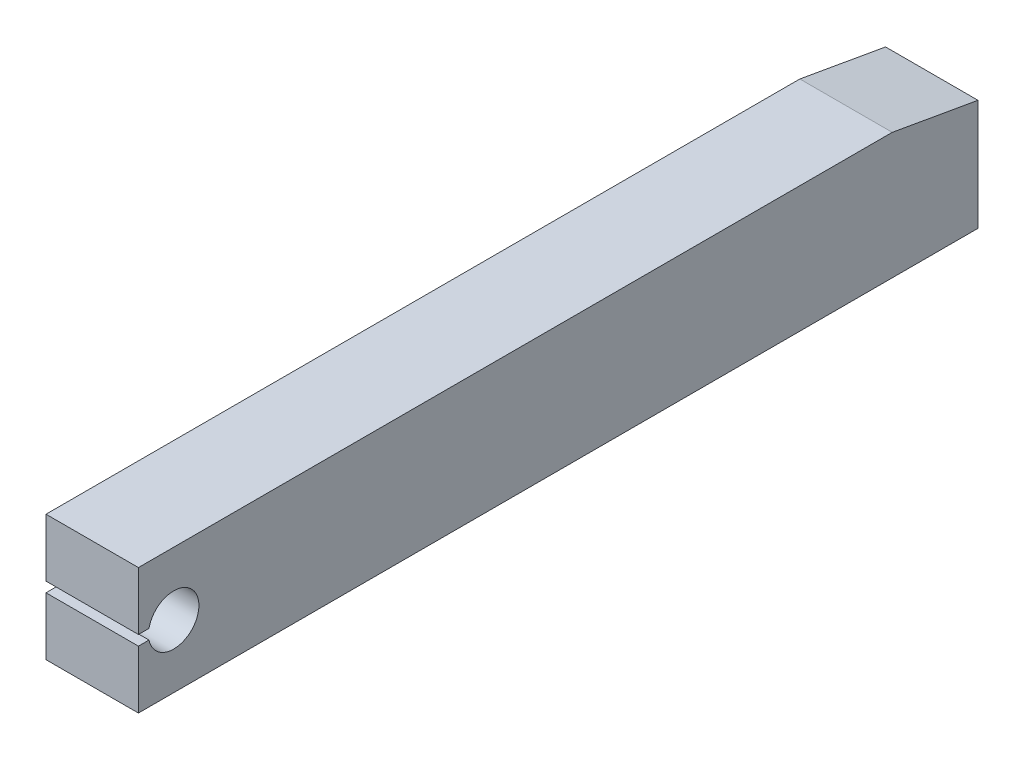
ISO-10303-21;
HEADER;
FILE_DESCRIPTION(('STEP AP214'),'2;1');
FILE_NAME('part.step','',(''),(''),'','','');
FILE_SCHEMA(('AUTOMOTIVE_DESIGN { 1 0 10303 214 1 1 1 1 }'));
ENDSEC;
DATA;
#1=APPLICATION_CONTEXT('core data for automotive mechanical design processes');
#2=APPLICATION_PROTOCOL_DEFINITION('international standard','automotive_design',2000,#1);
#3=PRODUCT_CONTEXT('',#1,'mechanical');
#4=PRODUCT('Part','Part','',(#3));
#5=PRODUCT_RELATED_PRODUCT_CATEGORY('part','',(#4));
#6=PRODUCT_DEFINITION_FORMATION('','',#4);
#7=PRODUCT_DEFINITION_CONTEXT('part definition',#1,'design');
#8=PRODUCT_DEFINITION('design','',#6,#7);
#9=PRODUCT_DEFINITION_SHAPE('','',#8);
#10=(LENGTH_UNIT() NAMED_UNIT(*) SI_UNIT(.MILLI.,.METRE.));
#11=(NAMED_UNIT(*) PLANE_ANGLE_UNIT() SI_UNIT($,.RADIAN.));
#12=(NAMED_UNIT(*) SI_UNIT($,.STERADIAN.) SOLID_ANGLE_UNIT());
#13=UNCERTAINTY_MEASURE_WITH_UNIT(LENGTH_MEASURE(1.E-05),#10,'distance_accuracy_value','');
#14=(GEOMETRIC_REPRESENTATION_CONTEXT(3) GLOBAL_UNCERTAINTY_ASSIGNED_CONTEXT((#13)) GLOBAL_UNIT_ASSIGNED_CONTEXT((#10,
#11,#12)) REPRESENTATION_CONTEXT('',''));
#15=CARTESIAN_POINT('',(0.,0.,0.));
#16=DIRECTION('',(0.,0.,1.));
#17=DIRECTION('',(1.,0.,0.));
#18=AXIS2_PLACEMENT_3D('',#15,#16,#17);
#19=CARTESIAN_POINT('',(9.47205,8.411975,0.));
#20=DIRECTION('',(0.,0.,-1.));
#21=DIRECTION('',(-1.,0.,0.));
#22=AXIS2_PLACEMENT_3D('',#19,#20,#21);
#23=PLANE('',#22);
#24=DIRECTION('',(0.,-1.,0.));
#25=VECTOR('',#24,1.);
#26=CARTESIAN_POINT('',(5.80545,3.411975,0.));
#27=LINE('',#26,#25);
#28=CARTESIAN_POINT('',(5.80545,8.411975,0.));
#29=VERTEX_POINT('',#28);
#30=CARTESIAN_POINT('',(5.80545,6.111975,0.));
#31=VERTEX_POINT('',#30);
#32=EDGE_CURVE('E144',#29,#31,#27,.T.);
#33=ORIENTED_EDGE('',*,*,#32,.T.);
#34=DIRECTION('',(-1.,0.,0.));
#35=VECTOR('',#34,1.);
#36=CARTESIAN_POINT('',(9.47205,6.111975,0.));
#37=LINE('',#36,#35);
#38=CARTESIAN_POINT('',(9.47205,6.111975,0.));
#39=VERTEX_POINT('',#38);
#40=EDGE_CURVE('E133',#39,#31,#37,.T.);
#41=ORIENTED_EDGE('',*,*,#40,.F.);
#42=DIRECTION('',(0.,1.,0.));
#43=VECTOR('',#42,1.);
#44=CARTESIAN_POINT('',(9.47205,8.411975,0.));
#45=LINE('',#44,#43);
#46=CARTESIAN_POINT('',(9.47205,8.411975,0.));
#47=VERTEX_POINT('',#46);
#48=EDGE_CURVE('E140',#39,#47,#45,.T.);
#49=ORIENTED_EDGE('',*,*,#48,.T.);
#50=DIRECTION('',(-1.,0.,0.));
#51=VECTOR('',#50,1.);
#52=CARTESIAN_POINT('',(5.80545,8.411975,0.));
#53=LINE('',#52,#51);
#54=EDGE_CURVE('E132',#47,#29,#53,.T.);
#55=ORIENTED_EDGE('',*,*,#54,.T.);
#56=EDGE_LOOP('',(#33,#41,#49,#55));
#57=FACE_BOUND('',#56,.T.);
#58=ADVANCED_FACE('F29',(#57),#23,.F.);
#59=CARTESIAN_POINT('',(3.94041162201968,3.411975,-33.311));
#60=DIRECTION('',(0.,0.,-1.));
#61=DIRECTION('',(-1.,0.,0.));
#62=AXIS2_PLACEMENT_3D('',#59,#60,#61);
#63=PLANE('',#62);
#64=DIRECTION('',(0.,-1.,0.));
#65=VECTOR('',#64,1.);
#66=CARTESIAN_POINT('',(5.80545,3.411975,-33.311));
#67=LINE('',#66,#65);
#68=CARTESIAN_POINT('',(5.80545,7.811975,-33.311));
#69=VERTEX_POINT('',#68);
#70=CARTESIAN_POINT('',(5.80545,3.411975,-33.311));
#71=VERTEX_POINT('',#70);
#72=EDGE_CURVE('E139',#69,#71,#67,.T.);
#73=ORIENTED_EDGE('',*,*,#72,.F.);
#74=DIRECTION('',(1.,0.,0.));
#75=VECTOR('',#74,1.);
#76=CARTESIAN_POINT('',(3.94041162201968,7.811975,-33.311));
#77=LINE('',#76,#75);
#78=CARTESIAN_POINT('',(9.47205,7.811975,-33.311));
#79=VERTEX_POINT('',#78);
#80=EDGE_CURVE('E37',#69,#79,#77,.T.);
#81=ORIENTED_EDGE('',*,*,#80,.T.);
#82=DIRECTION('',(0.,1.,0.));
#83=VECTOR('',#82,1.);
#84=CARTESIAN_POINT('',(9.47205,8.411975,-33.311));
#85=LINE('',#84,#83);
#86=CARTESIAN_POINT('',(9.47205,3.411975,-33.311));
#87=VERTEX_POINT('',#86);
#88=EDGE_CURVE('E151',#87,#79,#85,.T.);
#89=ORIENTED_EDGE('',*,*,#88,.F.);
#90=DIRECTION('',(1.,0.,0.));
#91=VECTOR('',#90,1.);
#92=CARTESIAN_POINT('',(5.80545,3.411975,-33.311));
#93=LINE('',#92,#91);
#94=EDGE_CURVE('E155',#71,#87,#93,.T.);
#95=ORIENTED_EDGE('',*,*,#94,.F.);
#96=EDGE_LOOP('',(#73,#81,#89,#95));
#97=FACE_BOUND('',#96,.T.);
#98=ADVANCED_FACE('F31',(#97),#63,.T.);
#99=CARTESIAN_POINT('',(9.47205,3.411975,0.));
#100=VERTEX_POINT('',#99);
#101=CARTESIAN_POINT('',(9.47205,5.711975,0.));
#102=VERTEX_POINT('',#101);
#103=EDGE_CURVE('E136',#100,#102,#45,.T.);
#104=ORIENTED_EDGE('',*,*,#103,.T.);
#105=DIRECTION('',(-1.,0.,0.));
#106=VECTOR('',#105,1.);
#107=CARTESIAN_POINT('',(9.47205,5.711975,0.));
#108=LINE('',#107,#106);
#109=CARTESIAN_POINT('',(5.80545,5.711975,0.));
#110=VERTEX_POINT('',#109);
#111=EDGE_CURVE('E108',#102,#110,#108,.T.);
#112=ORIENTED_EDGE('',*,*,#111,.T.);
#113=CARTESIAN_POINT('',(5.80545,3.411975,0.));
#114=VERTEX_POINT('',#113);
#115=EDGE_CURVE('E121',#110,#114,#27,.T.);
#116=ORIENTED_EDGE('',*,*,#115,.T.);
#117=DIRECTION('',(1.,0.,0.));
#118=VECTOR('',#117,1.);
#119=CARTESIAN_POINT('',(5.80545,3.411975,0.));
#120=LINE('',#119,#118);
#121=EDGE_CURVE('E141',#114,#100,#120,.T.);
#122=ORIENTED_EDGE('',*,*,#121,.T.);
#123=EDGE_LOOP('',(#104,#112,#116,#122));
#124=FACE_BOUND('',#123,.T.);
#125=ADVANCED_FACE('F192',(#124),#23,.F.);
#126=CARTESIAN_POINT('',(5.80545,3.411975,-39.5113189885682));
#127=DIRECTION('',(-1.,0.,0.));
#128=DIRECTION('',(0.,0.,1.));
#129=AXIS2_PLACEMENT_3D('',#126,#127,#128);
#130=PLANE('',#129);
#131=DIRECTION('',(0.,0.,1.));
#132=VECTOR('',#131,1.);
#133=CARTESIAN_POINT('',(5.80545,8.411975,-39.5113189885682));
#134=LINE('',#133,#132);
#135=CARTESIAN_POINT('',(5.80545,8.411975,-29.9082309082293));
#136=VERTEX_POINT('',#135);
#137=EDGE_CURVE('E159',#136,#29,#134,.T.);
#138=ORIENTED_EDGE('',*,*,#137,.F.);
#139=DIRECTION('',(0.,0.173648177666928,0.984807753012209));
#140=VECTOR('',#139,1.);
#141=CARTESIAN_POINT('',(5.80545,6.61898177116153,-40.0768008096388));
#142=LINE('',#141,#140);
#143=EDGE_CURVE('E51',#136,#69,#142,.F.);
#144=ORIENTED_EDGE('',*,*,#143,.T.);
#145=ORIENTED_EDGE('',*,*,#72,.T.);
#146=DIRECTION('',(0.,0.,1.));
#147=VECTOR('',#146,1.);
#148=CARTESIAN_POINT('',(5.80545,3.411975,-39.5113189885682));
#149=LINE('',#148,#147);
#150=EDGE_CURVE('E150',#71,#114,#149,.T.);
#151=ORIENTED_EDGE('',*,*,#150,.T.);
#152=ORIENTED_EDGE('',*,*,#115,.F.);
#153=DIRECTION('',(0.,0.,1.));
#154=VECTOR('',#153,1.);
#155=CARTESIAN_POINT('',(5.80545,5.711975,-0.420204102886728));
#156=LINE('',#155,#154);
#157=CARTESIAN_POINT('',(5.80545,5.711975,-0.420204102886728));
#158=VERTEX_POINT('',#157);
#159=EDGE_CURVE('E101',#158,#110,#156,.T.);
#160=ORIENTED_EDGE('',*,*,#159,.F.);
#161=CARTESIAN_POINT('',(5.80545,5.911975,-1.4));
#162=DIRECTION('',(-1.,0.,0.));
#163=DIRECTION('',(0.,0.,1.));
#164=AXIS2_PLACEMENT_3D('',#161,#162,#163);
#165=CIRCLE('',#164,1.);
#166=CARTESIAN_POINT('',(5.80545,6.111975,-0.420204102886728));
#167=VERTEX_POINT('',#166);
#168=EDGE_CURVE('E112',#167,#158,#165,.T.);
#169=ORIENTED_EDGE('',*,*,#168,.F.);
#170=DIRECTION('',(0.,0.,-1.));
#171=VECTOR('',#170,1.);
#172=CARTESIAN_POINT('',(5.80545,6.111975,-0.420204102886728));
#173=LINE('',#172,#171);
#174=EDGE_CURVE('E122',#31,#167,#173,.T.);
#175=ORIENTED_EDGE('',*,*,#174,.F.);
#176=ORIENTED_EDGE('',*,*,#32,.F.);
#177=EDGE_LOOP('',(#138,#144,#145,#151,#152,#160,#169,#175,#176));
#178=FACE_BOUND('',#177,.T.);
#179=ADVANCED_FACE('F119',(#178),#130,.T.);
#180=CARTESIAN_POINT('',(5.80545,3.411975,-39.5113189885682));
#181=DIRECTION('',(0.,-1.,0.));
#182=DIRECTION('',(0.,0.,-1.));
#183=AXIS2_PLACEMENT_3D('',#180,#181,#182);
#184=PLANE('',#183);
#185=ORIENTED_EDGE('',*,*,#150,.F.);
#186=ORIENTED_EDGE('',*,*,#94,.T.);
#187=DIRECTION('',(0.,0.,1.));
#188=VECTOR('',#187,1.);
#189=CARTESIAN_POINT('',(9.47205,3.411975,-39.5113189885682));
#190=LINE('',#189,#188);
#191=EDGE_CURVE('E154',#87,#100,#190,.T.);
#192=ORIENTED_EDGE('',*,*,#191,.T.);
#193=ORIENTED_EDGE('',*,*,#121,.F.);
#194=EDGE_LOOP('',(#185,#186,#192,#193));
#195=FACE_BOUND('',#194,.T.);
#196=ADVANCED_FACE('F203',(#195),#184,.T.);
#197=CARTESIAN_POINT('',(9.47205,8.411975,-39.5113189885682));
#198=DIRECTION('',(1.,0.,0.));
#199=DIRECTION('',(0.,0.,-1.));
#200=AXIS2_PLACEMENT_3D('',#197,#198,#199);
#201=PLANE('',#200);
#202=ORIENTED_EDGE('',*,*,#88,.T.);
#203=DIRECTION('',(0.,-0.173648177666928,-0.984807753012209));
#204=VECTOR('',#203,1.);
#205=CARTESIAN_POINT('',(9.47205,6.76975021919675,-39.2217504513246));
#206=LINE('',#205,#204);
#207=CARTESIAN_POINT('',(9.47205,8.411975,-29.9082309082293));
#208=VERTEX_POINT('',#207);
#209=EDGE_CURVE('E11',#79,#208,#206,.F.);
#210=ORIENTED_EDGE('',*,*,#209,.T.);
#211=DIRECTION('',(0.,0.,1.));
#212=VECTOR('',#211,1.);
#213=CARTESIAN_POINT('',(9.47205,8.411975,-39.5113189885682));
#214=LINE('',#213,#212);
#215=EDGE_CURVE('E153',#208,#47,#214,.T.);
#216=ORIENTED_EDGE('',*,*,#215,.T.);
#217=ORIENTED_EDGE('',*,*,#48,.F.);
#218=DIRECTION('',(0.,0.,-1.));
#219=VECTOR('',#218,1.);
#220=CARTESIAN_POINT('',(9.47205,6.111975,-0.420204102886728));
#221=LINE('',#220,#219);
#222=CARTESIAN_POINT('',(9.47205,6.111975,-0.420204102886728));
#223=VERTEX_POINT('',#222);
#224=EDGE_CURVE('E109',#39,#223,#221,.T.);
#225=ORIENTED_EDGE('',*,*,#224,.T.);
#226=CARTESIAN_POINT('',(9.47205,5.911975,-1.4));
#227=DIRECTION('',(-1.,0.,0.));
#228=DIRECTION('',(0.,0.,1.));
#229=AXIS2_PLACEMENT_3D('',#226,#227,#228);
#230=CIRCLE('',#229,1.);
#231=CARTESIAN_POINT('',(9.47205,5.711975,-0.420204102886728));
#232=VERTEX_POINT('',#231);
#233=EDGE_CURVE('E124',#223,#232,#230,.T.);
#234=ORIENTED_EDGE('',*,*,#233,.T.);
#235=DIRECTION('',(0.,0.,1.));
#236=VECTOR('',#235,1.);
#237=CARTESIAN_POINT('',(9.47205,5.711975,-0.420204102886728));
#238=LINE('',#237,#236);
#239=EDGE_CURVE('E104',#232,#102,#238,.T.);
#240=ORIENTED_EDGE('',*,*,#239,.T.);
#241=ORIENTED_EDGE('',*,*,#103,.F.);
#242=ORIENTED_EDGE('',*,*,#191,.F.);
#243=EDGE_LOOP('',(#202,#210,#216,#217,#225,#234,#240,#241,#242));
#244=FACE_BOUND('',#243,.T.);
#245=ADVANCED_FACE('F179',(#244),#201,.T.);
#246=CARTESIAN_POINT('',(5.80545,8.411975,-39.5113189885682));
#247=DIRECTION('',(0.,1.,0.));
#248=DIRECTION('',(0.,0.,1.));
#249=AXIS2_PLACEMENT_3D('',#246,#247,#248);
#250=PLANE('',#249);
#251=ORIENTED_EDGE('',*,*,#215,.F.);
#252=DIRECTION('',(-1.,0.,0.));
#253=VECTOR('',#252,1.);
#254=CARTESIAN_POINT('',(5.80545,8.411975,-29.9082309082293));
#255=LINE('',#254,#253);
#256=EDGE_CURVE('E163',#208,#136,#255,.T.);
#257=ORIENTED_EDGE('',*,*,#256,.T.);
#258=ORIENTED_EDGE('',*,*,#137,.T.);
#259=ORIENTED_EDGE('',*,*,#54,.F.);
#260=EDGE_LOOP('',(#251,#257,#258,#259));
#261=FACE_BOUND('',#260,.T.);
#262=ADVANCED_FACE('F169',(#261),#250,.T.);
#263=CARTESIAN_POINT('',(9.47205,5.911975,-1.4));
#264=DIRECTION('',(-1.,0.,0.));
#265=DIRECTION('',(0.,0.,1.));
#266=AXIS2_PLACEMENT_3D('',#263,#264,#265);
#267=CYLINDRICAL_SURFACE('',#266,1.);
#268=ORIENTED_EDGE('',*,*,#168,.T.);
#269=DIRECTION('',(-1.,0.,0.));
#270=VECTOR('',#269,1.);
#271=CARTESIAN_POINT('',(9.47205,5.711975,-0.420204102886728));
#272=LINE('',#271,#270);
#273=EDGE_CURVE('E97',#232,#158,#272,.T.);
#274=ORIENTED_EDGE('',*,*,#273,.F.);
#275=ORIENTED_EDGE('',*,*,#233,.F.);
#276=DIRECTION('',(-1.,0.,0.));
#277=VECTOR('',#276,1.);
#278=CARTESIAN_POINT('',(9.47205,6.111975,-0.420204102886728));
#279=LINE('',#278,#277);
#280=EDGE_CURVE('E114',#223,#167,#279,.T.);
#281=ORIENTED_EDGE('',*,*,#280,.T.);
#282=EDGE_LOOP('',(#268,#274,#275,#281));
#283=FACE_BOUND('',#282,.T.);
#284=ADVANCED_FACE('F113',(#283),#267,.F.);
#285=CARTESIAN_POINT('',(9.47205,6.111975,-0.420204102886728));
#286=DIRECTION('',(0.,1.,0.));
#287=DIRECTION('',(0.,0.,1.));
#288=AXIS2_PLACEMENT_3D('',#285,#286,#287);
#289=PLANE('',#288);
#290=ORIENTED_EDGE('',*,*,#174,.T.);
#291=ORIENTED_EDGE('',*,*,#280,.F.);
#292=ORIENTED_EDGE('',*,*,#224,.F.);
#293=ORIENTED_EDGE('',*,*,#40,.T.);
#294=EDGE_LOOP('',(#290,#291,#292,#293));
#295=FACE_BOUND('',#294,.T.);
#296=ADVANCED_FACE('F187',(#295),#289,.F.);
#297=CARTESIAN_POINT('',(9.47205,5.711975,-0.420204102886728));
#298=DIRECTION('',(0.,-1.,0.));
#299=DIRECTION('',(0.,0.,-1.));
#300=AXIS2_PLACEMENT_3D('',#297,#298,#299);
#301=PLANE('',#300);
#302=ORIENTED_EDGE('',*,*,#159,.T.);
#303=ORIENTED_EDGE('',*,*,#111,.F.);
#304=ORIENTED_EDGE('',*,*,#239,.F.);
#305=ORIENTED_EDGE('',*,*,#273,.T.);
#306=EDGE_LOOP('',(#302,#303,#304,#305));
#307=FACE_BOUND('',#306,.T.);
#308=ADVANCED_FACE('F99',(#307),#301,.F.);
#309=CARTESIAN_POINT('',(5.80545,8.411975,-29.9082309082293));
#310=DIRECTION('',(0.,-0.984807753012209,0.173648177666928));
#311=DIRECTION('',(0.,-0.173648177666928,-0.984807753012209));
#312=AXIS2_PLACEMENT_3D('',#309,#310,#311);
#313=PLANE('',#312);
#314=ORIENTED_EDGE('',*,*,#209,.F.);
#315=ORIENTED_EDGE('',*,*,#80,.F.);
#316=ORIENTED_EDGE('',*,*,#143,.F.);
#317=ORIENTED_EDGE('',*,*,#256,.F.);
#318=EDGE_LOOP('',(#314,#315,#316,#317));
#319=FACE_BOUND('',#318,.T.);
#320=ADVANCED_FACE('F181',(#319),#313,.F.);
#321=CLOSED_SHELL('',(#58,#98,#125,#179,#196,#245,#262,#284,#296,#308,#320));
#322=MANIFOLD_SOLID_BREP('B2',#321);
#323=ADVANCED_BREP_SHAPE_REPRESENTATION('',(#18,#322),#14);
#324=SHAPE_DEFINITION_REPRESENTATION(#9,#323);
ENDSEC;
END-ISO-10303-21;
